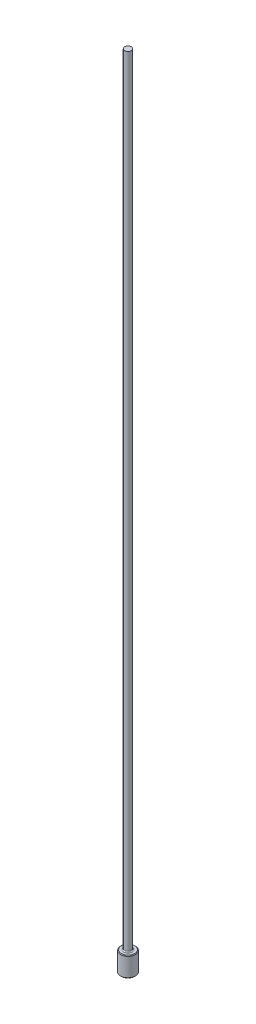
ISO-10303-21;
HEADER;
FILE_DESCRIPTION(('STEP AP214'),'2;1');
FILE_NAME('part.step','',(''),(''),'','','');
FILE_SCHEMA(('AUTOMOTIVE_DESIGN { 1 0 10303 214 1 1 1 1 }'));
ENDSEC;
DATA;
#1=APPLICATION_CONTEXT('core data for automotive mechanical design processes');
#2=APPLICATION_PROTOCOL_DEFINITION('international standard','automotive_design',2000,#1);
#3=PRODUCT_CONTEXT('',#1,'mechanical');
#4=PRODUCT('Part','Part','',(#3));
#5=PRODUCT_RELATED_PRODUCT_CATEGORY('part','',(#4));
#6=PRODUCT_DEFINITION_FORMATION('','',#4);
#7=PRODUCT_DEFINITION_CONTEXT('part definition',#1,'design');
#8=PRODUCT_DEFINITION('design','',#6,#7);
#9=PRODUCT_DEFINITION_SHAPE('','',#8);
#10=(LENGTH_UNIT() NAMED_UNIT(*) SI_UNIT(.MILLI.,.METRE.));
#11=(NAMED_UNIT(*) PLANE_ANGLE_UNIT() SI_UNIT($,.RADIAN.));
#12=(NAMED_UNIT(*) SI_UNIT($,.STERADIAN.) SOLID_ANGLE_UNIT());
#13=UNCERTAINTY_MEASURE_WITH_UNIT(LENGTH_MEASURE(1.E-05),#10,'distance_accuracy_value','');
#14=(GEOMETRIC_REPRESENTATION_CONTEXT(3) GLOBAL_UNCERTAINTY_ASSIGNED_CONTEXT((#13)) GLOBAL_UNIT_ASSIGNED_CONTEXT((#10,
#11,#12)) REPRESENTATION_CONTEXT('',''));
#15=CARTESIAN_POINT('',(0.,0.,0.));
#16=DIRECTION('',(0.,0.,1.));
#17=DIRECTION('',(1.,0.,0.));
#18=AXIS2_PLACEMENT_3D('',#15,#16,#17);
#19=CARTESIAN_POINT('',(0.,0.,0.));
#20=DIRECTION('',(0.,-1.,0.));
#21=DIRECTION('',(0.,0.,-1.));
#22=AXIS2_PLACEMENT_3D('',#19,#20,#21);
#23=PLANE('',#22);
#24=CARTESIAN_POINT('',(0.,0.,0.));
#25=DIRECTION('',(0.,-1.,0.));
#26=DIRECTION('',(0.,0.,-1.));
#27=AXIS2_PLACEMENT_3D('',#24,#25,#26);
#28=CIRCLE('',#27,0.533399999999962);
#29=CARTESIAN_POINT('',(0.,0.,-0.533399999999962));
#30=VERTEX_POINT('',#29);
#31=EDGE_CURVE('E46',#30,#30,#28,.T.);
#32=ORIENTED_EDGE('',*,*,#31,.T.);
#33=EDGE_LOOP('',(#32));
#34=FACE_BOUND('',#33,.T.);
#35=ADVANCED_FACE('F35',(#34),#23,.T.);
#36=CARTESIAN_POINT('',(0.,259.958771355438,0.));
#37=DIRECTION('',(0.,1.,0.));
#38=DIRECTION('',(0.,0.,1.));
#39=AXIS2_PLACEMENT_3D('',#36,#37,#38);
#40=CYLINDRICAL_SURFACE('',#39,0.584199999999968);
#41=CARTESIAN_POINT('',(0.,1.52399999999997,0.));
#42=DIRECTION('',(0.,1.,0.));
#43=DIRECTION('',(0.,0.,1.));
#44=AXIS2_PLACEMENT_3D('',#41,#42,#43);
#45=CIRCLE('',#44,0.584199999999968);
#46=CARTESIAN_POINT('',(0.,1.52399999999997,0.584199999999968));
#47=VERTEX_POINT('',#46);
#48=EDGE_CURVE('E50',#47,#47,#45,.F.);
#49=ORIENTED_EDGE('',*,*,#48,.T.);
#50=EDGE_LOOP('',(#49));
#51=FACE_BOUND('',#50,.T.);
#52=CARTESIAN_POINT('',(0.,0.0508000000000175,0.));
#53=DIRECTION('',(0.,-1.,0.));
#54=DIRECTION('',(0.,0.,-1.));
#55=AXIS2_PLACEMENT_3D('',#52,#53,#54);
#56=CIRCLE('',#55,0.584199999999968);
#57=CARTESIAN_POINT('',(0.,0.0508000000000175,-0.584199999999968));
#58=VERTEX_POINT('',#57);
#59=EDGE_CURVE('E55',#58,#58,#56,.F.);
#60=ORIENTED_EDGE('',*,*,#59,.T.);
#61=EDGE_LOOP('',(#60));
#62=FACE_BOUND('',#61,.T.);
#63=ADVANCED_FACE('F77',(#51,#62),#40,.T.);
#64=CARTESIAN_POINT('',(-0.584199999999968,1.5748,0.));
#65=DIRECTION('',(0.,1.,0.));
#66=DIRECTION('',(0.,0.,1.));
#67=AXIS2_PLACEMENT_3D('',#64,#65,#66);
#68=PLANE('',#67);
#69=CARTESIAN_POINT('',(0.,1.5748,0.));
#70=DIRECTION('',(0.,1.,0.));
#71=DIRECTION('',(0.,0.,1.));
#72=AXIS2_PLACEMENT_3D('',#69,#70,#71);
#73=CIRCLE('',#72,0.342899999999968);
#74=CARTESIAN_POINT('',(0.,1.5748,0.342899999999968));
#75=VERTEX_POINT('',#74);
#76=EDGE_CURVE('E10',#75,#75,#73,.F.);
#77=ORIENTED_EDGE('',*,*,#76,.T.);
#78=EDGE_LOOP('',(#77));
#79=FACE_BOUND('',#78,.T.);
#80=CARTESIAN_POINT('',(0.,1.5748,0.));
#81=DIRECTION('',(0.,1.,0.));
#82=DIRECTION('',(0.,0.,1.));
#83=AXIS2_PLACEMENT_3D('',#80,#81,#82);
#84=CIRCLE('',#83,0.533399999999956);
#85=CARTESIAN_POINT('',(0.,1.5748,0.533399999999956));
#86=VERTEX_POINT('',#85);
#87=EDGE_CURVE('E58',#86,#86,#84,.T.);
#88=ORIENTED_EDGE('',*,*,#87,.T.);
#89=EDGE_LOOP('',(#88));
#90=FACE_BOUND('',#89,.T.);
#91=ADVANCED_FACE('F69',(#79,#90),#68,.T.);
#92=CARTESIAN_POINT('',(0.,259.958771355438,0.));
#93=DIRECTION('',(0.,1.,0.));
#94=DIRECTION('',(0.,0.,1.));
#95=AXIS2_PLACEMENT_3D('',#92,#93,#94);
#96=CYLINDRICAL_SURFACE('',#95,0.266699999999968);
#97=CARTESIAN_POINT('',(0.,1.65100000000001,0.));
#98=DIRECTION('',(0.,1.,0.));
#99=DIRECTION('',(0.,0.,1.));
#100=AXIS2_PLACEMENT_3D('',#97,#98,#99);
#101=CIRCLE('',#100,0.266699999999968);
#102=CARTESIAN_POINT('',(0.,1.65100000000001,0.266699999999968));
#103=VERTEX_POINT('',#102);
#104=EDGE_CURVE('E42',#103,#103,#101,.T.);
#105=ORIENTED_EDGE('',*,*,#104,.T.);
#106=EDGE_LOOP('',(#105));
#107=FACE_BOUND('',#106,.T.);
#108=CARTESIAN_POINT('',(0.,63.5,0.));
#109=DIRECTION('',(0.,1.,0.));
#110=DIRECTION('',(0.,0.,1.));
#111=AXIS2_PLACEMENT_3D('',#108,#109,#110);
#112=CIRCLE('',#111,0.266699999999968);
#113=CARTESIAN_POINT('',(0.,63.5,0.266699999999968));
#114=VERTEX_POINT('',#113);
#115=EDGE_CURVE('E61',#114,#114,#112,.T.);
#116=ORIENTED_EDGE('',*,*,#115,.F.);
#117=EDGE_LOOP('',(#116));
#118=FACE_BOUND('',#117,.T.);
#119=ADVANCED_FACE('F67',(#107,#118),#96,.T.);
#120=CARTESIAN_POINT('',(-0.266699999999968,63.5,0.));
#121=DIRECTION('',(0.,1.,0.));
#122=DIRECTION('',(0.,0.,1.));
#123=AXIS2_PLACEMENT_3D('',#120,#121,#122);
#124=PLANE('',#123);
#125=ORIENTED_EDGE('',*,*,#115,.T.);
#126=EDGE_LOOP('',(#125));
#127=FACE_BOUND('',#126,.T.);
#128=ADVANCED_FACE('F65',(#127),#124,.T.);
#129=CARTESIAN_POINT('',(0.,1.57479999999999,0.));
#130=DIRECTION('',(0.,-1.,0.));
#131=DIRECTION('',(0.,0.,-1.));
#132=AXIS2_PLACEMENT_3D('',#129,#130,#131);
#133=CONICAL_SURFACE('',#132,0.533399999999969,0.785398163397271);
#134=ORIENTED_EDGE('',*,*,#48,.F.);
#135=EDGE_LOOP('',(#134));
#136=FACE_BOUND('',#135,.T.);
#137=ORIENTED_EDGE('',*,*,#87,.F.);
#138=EDGE_LOOP('',(#137));
#139=FACE_BOUND('',#138,.T.);
#140=ADVANCED_FACE('F75',(#136,#139),#133,.T.);
#141=CARTESIAN_POINT('',(0.,0.0508000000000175,0.));
#142=DIRECTION('',(0.,1.,0.));
#143=DIRECTION('',(0.,0.,1.));
#144=AXIS2_PLACEMENT_3D('',#141,#142,#143);
#145=CONICAL_SURFACE('',#144,0.584199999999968,0.785398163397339);
#146=ORIENTED_EDGE('',*,*,#31,.F.);
#147=EDGE_LOOP('',(#146));
#148=FACE_BOUND('',#147,.T.);
#149=ORIENTED_EDGE('',*,*,#59,.F.);
#150=EDGE_LOOP('',(#149));
#151=FACE_BOUND('',#150,.T.);
#152=ADVANCED_FACE('F89',(#148,#151),#145,.T.);
#153=CARTESIAN_POINT('',(0.,1.65100000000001,0.));
#154=DIRECTION('',(0.,1.,0.));
#155=DIRECTION('',(0.,0.,1.));
#156=AXIS2_PLACEMENT_3D('',#153,#154,#155);
#157=TOROIDAL_SURFACE('',#156,0.342899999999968,0.0762);
#158=ORIENTED_EDGE('',*,*,#76,.F.);
#159=EDGE_LOOP('',(#158));
#160=FACE_BOUND('',#159,.T.);
#161=ORIENTED_EDGE('',*,*,#104,.F.);
#162=EDGE_LOOP('',(#161));
#163=FACE_BOUND('',#162,.T.);
#164=ADVANCED_FACE('F37',(#160,#163),#157,.F.);
#165=CLOSED_SHELL('',(#35,#63,#91,#119,#128,#140,#152,#164));
#166=MANIFOLD_SOLID_BREP('B2',#165);
#167=ADVANCED_BREP_SHAPE_REPRESENTATION('',(#18,#166),#14);
#168=SHAPE_DEFINITION_REPRESENTATION(#9,#167);
ENDSEC;
END-ISO-10303-21;
